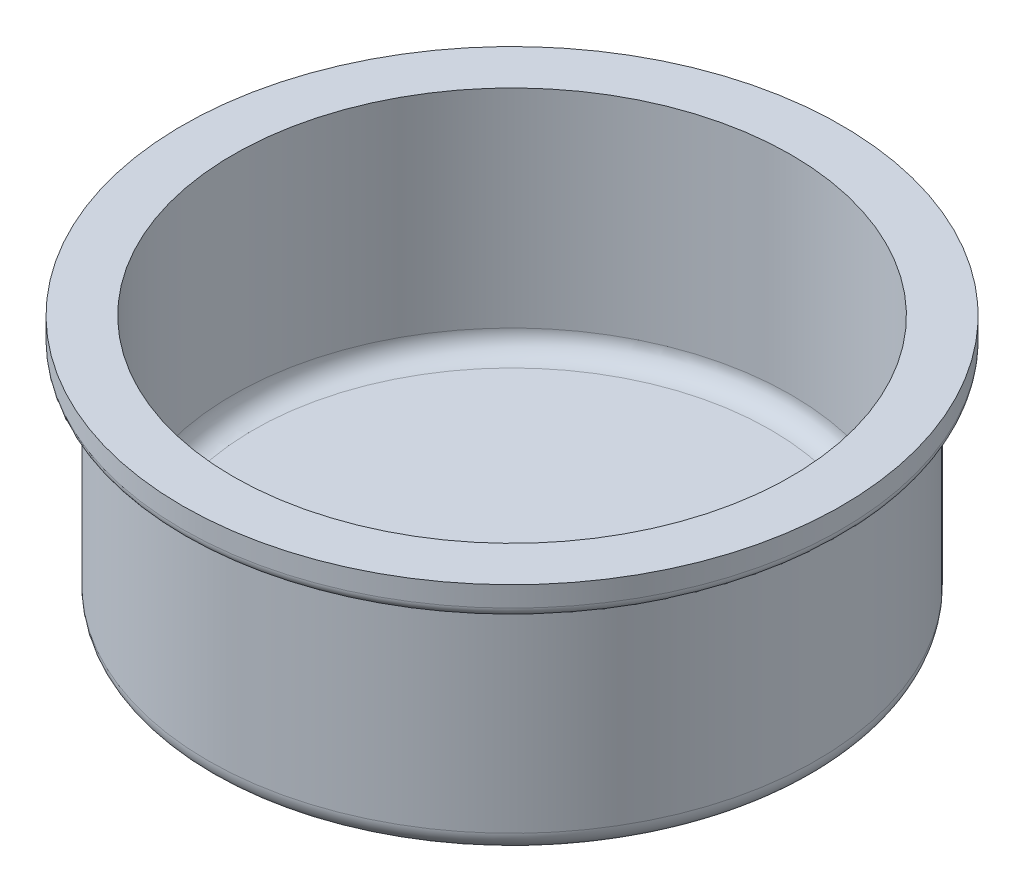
ISO-10303-21;
HEADER;
FILE_DESCRIPTION(('STEP AP214'),'2;1');
FILE_NAME('part.step','',(''),(''),'','','');
FILE_SCHEMA(('AUTOMOTIVE_DESIGN { 1 0 10303 214 1 1 1 1 }'));
ENDSEC;
DATA;
#1=APPLICATION_CONTEXT('core data for automotive mechanical design processes');
#2=APPLICATION_PROTOCOL_DEFINITION('international standard','automotive_design',2000,#1);
#3=PRODUCT_CONTEXT('',#1,'mechanical');
#4=PRODUCT('Part','Part','',(#3));
#5=PRODUCT_RELATED_PRODUCT_CATEGORY('part','',(#4));
#6=PRODUCT_DEFINITION_FORMATION('','',#4);
#7=PRODUCT_DEFINITION_CONTEXT('part definition',#1,'design');
#8=PRODUCT_DEFINITION('design','',#6,#7);
#9=PRODUCT_DEFINITION_SHAPE('','',#8);
#10=(LENGTH_UNIT() NAMED_UNIT(*) SI_UNIT(.MILLI.,.METRE.));
#11=(NAMED_UNIT(*) PLANE_ANGLE_UNIT() SI_UNIT($,.RADIAN.));
#12=(NAMED_UNIT(*) SI_UNIT($,.STERADIAN.) SOLID_ANGLE_UNIT());
#13=UNCERTAINTY_MEASURE_WITH_UNIT(LENGTH_MEASURE(1.E-05),#10,'distance_accuracy_value','');
#14=(GEOMETRIC_REPRESENTATION_CONTEXT(3) GLOBAL_UNCERTAINTY_ASSIGNED_CONTEXT((#13)) GLOBAL_UNIT_ASSIGNED_CONTEXT((#10,
#11,#12)) REPRESENTATION_CONTEXT('',''));
#15=CARTESIAN_POINT('',(0.,0.,0.));
#16=DIRECTION('',(0.,0.,1.));
#17=DIRECTION('',(1.,0.,0.));
#18=AXIS2_PLACEMENT_3D('',#15,#16,#17);
#19=CARTESIAN_POINT('',(0.,0.,0.));
#20=DIRECTION('',(0.,1.,0.));
#21=DIRECTION('',(0.,0.,1.));
#22=AXIS2_PLACEMENT_3D('',#19,#20,#21);
#23=PLANE('',#22);
#24=CARTESIAN_POINT('',(0.,0.,0.));
#25=DIRECTION('',(0.,1.,0.));
#26=DIRECTION('',(0.,0.,1.));
#27=AXIS2_PLACEMENT_3D('',#24,#25,#26);
#28=CIRCLE('',#27,28.);
#29=CARTESIAN_POINT('',(0.,0.,28.));
#30=VERTEX_POINT('',#29);
#31=EDGE_CURVE('E58',#30,#30,#28,.F.);
#32=ORIENTED_EDGE('',*,*,#31,.T.);
#33=EDGE_LOOP('',(#32));
#34=FACE_BOUND('',#33,.T.);
#35=ADVANCED_FACE('F32',(#34),#23,.F.);
#36=CARTESIAN_POINT('',(0.,54.1939534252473,0.));
#37=DIRECTION('',(0.,1.,0.));
#38=DIRECTION('',(0.,0.,1.));
#39=AXIS2_PLACEMENT_3D('',#36,#37,#38);
#40=CYLINDRICAL_SURFACE('',#39,30.);
#41=CARTESIAN_POINT('',(0.,21.,0.));
#42=DIRECTION('',(0.,1.,0.));
#43=DIRECTION('',(0.,0.,1.));
#44=AXIS2_PLACEMENT_3D('',#41,#42,#43);
#45=CIRCLE('',#44,30.);
#46=CARTESIAN_POINT('',(0.,21.,30.));
#47=VERTEX_POINT('',#46);
#48=EDGE_CURVE('E10',#47,#47,#45,.F.);
#49=ORIENTED_EDGE('',*,*,#48,.T.);
#50=EDGE_LOOP('',(#49));
#51=FACE_BOUND('',#50,.T.);
#52=CARTESIAN_POINT('',(0.,2.,0.));
#53=DIRECTION('',(0.,1.,0.));
#54=DIRECTION('',(0.,0.,1.));
#55=AXIS2_PLACEMENT_3D('',#52,#53,#54);
#56=CIRCLE('',#55,30.);
#57=CARTESIAN_POINT('',(0.,2.,30.));
#58=VERTEX_POINT('',#57);
#59=EDGE_CURVE('E61',#58,#58,#56,.T.);
#60=ORIENTED_EDGE('',*,*,#59,.T.);
#61=EDGE_LOOP('',(#60));
#62=FACE_BOUND('',#61,.T.);
#63=ADVANCED_FACE('F87',(#51,#62),#40,.T.);
#64=CARTESIAN_POINT('',(30.,22.,0.));
#65=DIRECTION('',(0.,1.,0.));
#66=DIRECTION('',(0.,0.,1.));
#67=AXIS2_PLACEMENT_3D('',#64,#65,#66);
#68=PLANE('',#67);
#69=CARTESIAN_POINT('',(0.,22.,0.));
#70=DIRECTION('',(0.,1.,0.));
#71=DIRECTION('',(0.,0.,1.));
#72=AXIS2_PLACEMENT_3D('',#69,#70,#71);
#73=CIRCLE('',#72,31.5);
#74=CARTESIAN_POINT('',(0.,22.,31.5));
#75=VERTEX_POINT('',#74);
#76=EDGE_CURVE('E39',#75,#75,#73,.F.);
#77=ORIENTED_EDGE('',*,*,#76,.T.);
#78=EDGE_LOOP('',(#77));
#79=FACE_BOUND('',#78,.T.);
#80=CARTESIAN_POINT('',(0.,22.,0.));
#81=DIRECTION('',(0.,1.,0.));
#82=DIRECTION('',(0.,0.,1.));
#83=AXIS2_PLACEMENT_3D('',#80,#81,#82);
#84=CIRCLE('',#83,31.);
#85=CARTESIAN_POINT('',(0.,22.,31.));
#86=VERTEX_POINT('',#85);
#87=EDGE_CURVE('E43',#86,#86,#84,.T.);
#88=ORIENTED_EDGE('',*,*,#87,.T.);
#89=EDGE_LOOP('',(#88));
#90=FACE_BOUND('',#89,.T.);
#91=ADVANCED_FACE('F81',(#79,#90),#68,.F.);
#92=CARTESIAN_POINT('',(0.,54.1939534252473,0.));
#93=DIRECTION('',(0.,1.,0.));
#94=DIRECTION('',(0.,0.,1.));
#95=AXIS2_PLACEMENT_3D('',#92,#93,#94);
#96=CYLINDRICAL_SURFACE('',#95,32.5);
#97=CARTESIAN_POINT('',(0.,23.,0.));
#98=DIRECTION('',(0.,1.,0.));
#99=DIRECTION('',(0.,0.,1.));
#100=AXIS2_PLACEMENT_3D('',#97,#98,#99);
#101=CIRCLE('',#100,32.5);
#102=CARTESIAN_POINT('',(0.,23.,32.5));
#103=VERTEX_POINT('',#102);
#104=EDGE_CURVE('E47',#103,#103,#101,.T.);
#105=ORIENTED_EDGE('',*,*,#104,.T.);
#106=EDGE_LOOP('',(#105));
#107=FACE_BOUND('',#106,.T.);
#108=CARTESIAN_POINT('',(0.,25.,0.));
#109=DIRECTION('',(0.,1.,0.));
#110=DIRECTION('',(0.,0.,1.));
#111=AXIS2_PLACEMENT_3D('',#108,#109,#110);
#112=CIRCLE('',#111,32.5);
#113=CARTESIAN_POINT('',(0.,25.,32.5));
#114=VERTEX_POINT('',#113);
#115=EDGE_CURVE('E64',#114,#114,#112,.T.);
#116=ORIENTED_EDGE('',*,*,#115,.F.);
#117=EDGE_LOOP('',(#116));
#118=FACE_BOUND('',#117,.T.);
#119=ADVANCED_FACE('F76',(#107,#118),#96,.T.);
#120=CARTESIAN_POINT('',(32.5,25.,0.));
#121=DIRECTION('',(0.,-1.,0.));
#122=DIRECTION('',(0.,0.,-1.));
#123=AXIS2_PLACEMENT_3D('',#120,#121,#122);
#124=PLANE('',#123);
#125=CARTESIAN_POINT('',(0.,25.,0.));
#126=DIRECTION('',(0.,1.,0.));
#127=DIRECTION('',(0.,0.,1.));
#128=AXIS2_PLACEMENT_3D('',#125,#126,#127);
#129=CIRCLE('',#128,27.5);
#130=CARTESIAN_POINT('',(0.,25.,27.5));
#131=VERTEX_POINT('',#130);
#132=EDGE_CURVE('E67',#131,#131,#129,.T.);
#133=ORIENTED_EDGE('',*,*,#132,.F.);
#134=EDGE_LOOP('',(#133));
#135=FACE_BOUND('',#134,.T.);
#136=ORIENTED_EDGE('',*,*,#115,.T.);
#137=EDGE_LOOP('',(#136));
#138=FACE_BOUND('',#137,.T.);
#139=ADVANCED_FACE('F73',(#135,#138),#124,.F.);
#140=CARTESIAN_POINT('',(0.,54.1939534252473,0.));
#141=DIRECTION('',(0.,1.,0.));
#142=DIRECTION('',(0.,0.,1.));
#143=AXIS2_PLACEMENT_3D('',#140,#141,#142);
#144=CYLINDRICAL_SURFACE('',#143,27.5);
#145=CARTESIAN_POINT('',(0.,4.5,0.));
#146=DIRECTION('',(0.,-1.,0.));
#147=DIRECTION('',(0.,0.,-1.));
#148=AXIS2_PLACEMENT_3D('',#145,#146,#147);
#149=CIRCLE('',#148,27.5);
#150=CARTESIAN_POINT('',(0.,4.5,-27.5));
#151=VERTEX_POINT('',#150);
#152=EDGE_CURVE('E52',#151,#151,#149,.T.);
#153=ORIENTED_EDGE('',*,*,#152,.T.);
#154=EDGE_LOOP('',(#153));
#155=FACE_BOUND('',#154,.T.);
#156=ORIENTED_EDGE('',*,*,#132,.T.);
#157=EDGE_LOOP('',(#156));
#158=FACE_BOUND('',#157,.T.);
#159=ADVANCED_FACE('F71',(#155,#158),#144,.F.);
#160=CARTESIAN_POINT('',(27.5,2.5,0.));
#161=DIRECTION('',(0.,-1.,0.));
#162=DIRECTION('',(0.,0.,-1.));
#163=AXIS2_PLACEMENT_3D('',#160,#161,#162);
#164=PLANE('',#163);
#165=CARTESIAN_POINT('',(0.,2.5,0.));
#166=DIRECTION('',(0.,-1.,0.));
#167=DIRECTION('',(0.,0.,-1.));
#168=AXIS2_PLACEMENT_3D('',#165,#166,#167);
#169=CIRCLE('',#168,25.5);
#170=CARTESIAN_POINT('',(0.,2.5,-25.5));
#171=VERTEX_POINT('',#170);
#172=EDGE_CURVE('E55',#171,#171,#169,.F.);
#173=ORIENTED_EDGE('',*,*,#172,.T.);
#174=EDGE_LOOP('',(#173));
#175=FACE_BOUND('',#174,.T.);
#176=ADVANCED_FACE('F101',(#175),#164,.F.);
#177=CARTESIAN_POINT('',(0.,2.,0.));
#178=DIRECTION('',(0.,1.,0.));
#179=DIRECTION('',(0.,0.,1.));
#180=AXIS2_PLACEMENT_3D('',#177,#178,#179);
#181=TOROIDAL_SURFACE('',#180,28.,2.);
#182=ORIENTED_EDGE('',*,*,#31,.F.);
#183=EDGE_LOOP('',(#182));
#184=FACE_BOUND('',#183,.T.);
#185=ORIENTED_EDGE('',*,*,#59,.F.);
#186=EDGE_LOOP('',(#185));
#187=FACE_BOUND('',#186,.T.);
#188=ADVANCED_FACE('F97',(#184,#187),#181,.T.);
#189=CARTESIAN_POINT('',(0.,4.5,0.));
#190=DIRECTION('',(0.,-1.,0.));
#191=DIRECTION('',(0.,0.,-1.));
#192=AXIS2_PLACEMENT_3D('',#189,#190,#191);
#193=TOROIDAL_SURFACE('',#192,25.5,2.);
#194=ORIENTED_EDGE('',*,*,#152,.F.);
#195=EDGE_LOOP('',(#194));
#196=FACE_BOUND('',#195,.T.);
#197=ORIENTED_EDGE('',*,*,#172,.F.);
#198=EDGE_LOOP('',(#197));
#199=FACE_BOUND('',#198,.T.);
#200=ADVANCED_FACE('F100',(#196,#199),#193,.F.);
#201=CARTESIAN_POINT('',(0.,23.,0.));
#202=DIRECTION('',(0.,1.,0.));
#203=DIRECTION('',(0.,0.,1.));
#204=AXIS2_PLACEMENT_3D('',#201,#202,#203);
#205=TOROIDAL_SURFACE('',#204,31.5,1.);
#206=ORIENTED_EDGE('',*,*,#76,.F.);
#207=EDGE_LOOP('',(#206));
#208=FACE_BOUND('',#207,.T.);
#209=ORIENTED_EDGE('',*,*,#104,.F.);
#210=EDGE_LOOP('',(#209));
#211=FACE_BOUND('',#210,.T.);
#212=ADVANCED_FACE('F104',(#208,#211),#205,.T.);
#213=CARTESIAN_POINT('',(0.,21.,0.));
#214=DIRECTION('',(0.,1.,0.));
#215=DIRECTION('',(0.,0.,1.));
#216=AXIS2_PLACEMENT_3D('',#213,#214,#215);
#217=TOROIDAL_SURFACE('',#216,31.,1.);
#218=ORIENTED_EDGE('',*,*,#48,.F.);
#219=EDGE_LOOP('',(#218));
#220=FACE_BOUND('',#219,.T.);
#221=ORIENTED_EDGE('',*,*,#87,.F.);
#222=EDGE_LOOP('',(#221));
#223=FACE_BOUND('',#222,.T.);
#224=ADVANCED_FACE('F34',(#220,#223),#217,.F.);
#225=CLOSED_SHELL('',(#35,#63,#91,#119,#139,#159,#176,#188,#200,#212,#224));
#226=MANIFOLD_SOLID_BREP('B2',#225);
#227=ADVANCED_BREP_SHAPE_REPRESENTATION('',(#18,#226),#14);
#228=SHAPE_DEFINITION_REPRESENTATION(#9,#227);
ENDSEC;
END-ISO-10303-21;
